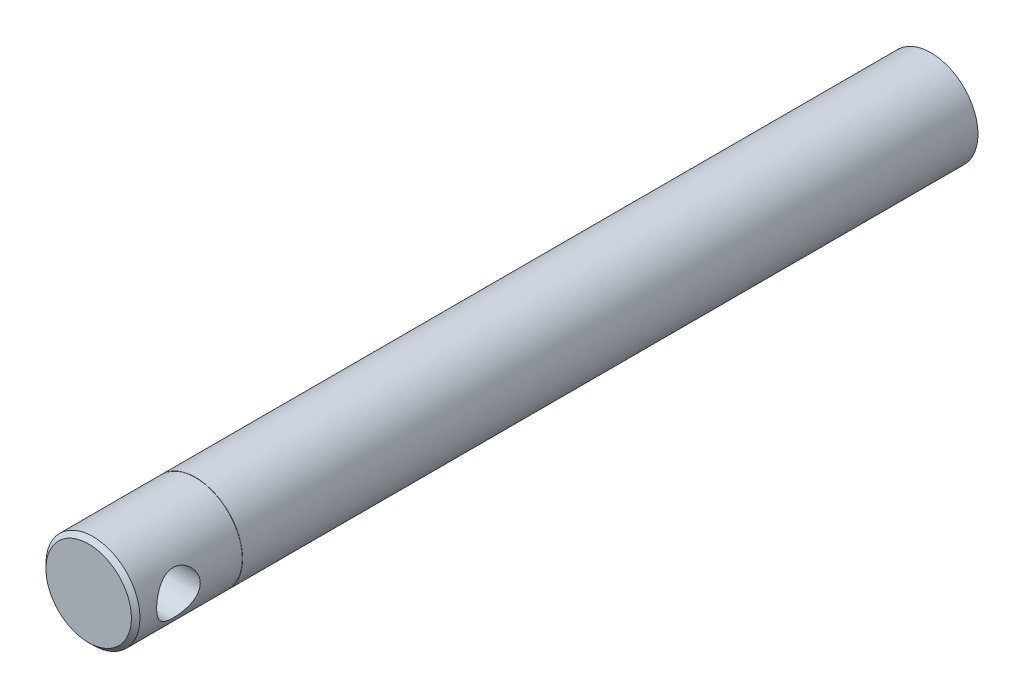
ISO-10303-21;
HEADER;
FILE_DESCRIPTION(('STEP AP214'),'2;1');
FILE_NAME('part.step','',(''),(''),'','','');
FILE_SCHEMA(('AUTOMOTIVE_DESIGN { 1 0 10303 214 1 1 1 1 }'));
ENDSEC;
DATA;
#1=APPLICATION_CONTEXT('core data for automotive mechanical design processes');
#2=APPLICATION_PROTOCOL_DEFINITION('international standard','automotive_design',2000,#1);
#3=PRODUCT_CONTEXT('',#1,'mechanical');
#4=PRODUCT('Part','Part','',(#3));
#5=PRODUCT_RELATED_PRODUCT_CATEGORY('part','',(#4));
#6=PRODUCT_DEFINITION_FORMATION('','',#4);
#7=PRODUCT_DEFINITION_CONTEXT('part definition',#1,'design');
#8=PRODUCT_DEFINITION('design','',#6,#7);
#9=PRODUCT_DEFINITION_SHAPE('','',#8);
#10=(LENGTH_UNIT() NAMED_UNIT(*) SI_UNIT(.MILLI.,.METRE.));
#11=(NAMED_UNIT(*) PLANE_ANGLE_UNIT() SI_UNIT($,.RADIAN.));
#12=(NAMED_UNIT(*) SI_UNIT($,.STERADIAN.) SOLID_ANGLE_UNIT());
#13=UNCERTAINTY_MEASURE_WITH_UNIT(LENGTH_MEASURE(1.E-05),#10,'distance_accuracy_value','');
#14=(GEOMETRIC_REPRESENTATION_CONTEXT(3) GLOBAL_UNCERTAINTY_ASSIGNED_CONTEXT((#13)) GLOBAL_UNIT_ASSIGNED_CONTEXT((#10,
#11,#12)) REPRESENTATION_CONTEXT('',''));
#15=CARTESIAN_POINT('',(0.,0.,0.));
#16=DIRECTION('',(0.,0.,1.));
#17=DIRECTION('',(1.,0.,0.));
#18=AXIS2_PLACEMENT_3D('',#15,#16,#17);
#19=CARTESIAN_POINT('',(0.,0.,172.));
#20=DIRECTION('',(0.,0.,1.));
#21=DIRECTION('',(1.,0.,0.));
#22=AXIS2_PLACEMENT_3D('',#19,#20,#21);
#23=PLANE('',#22);
#24=CARTESIAN_POINT('',(0.,0.,172.));
#25=DIRECTION('',(0.,0.,1.));
#26=DIRECTION('',(1.,0.,0.));
#27=AXIS2_PLACEMENT_3D('',#24,#25,#26);
#28=CIRCLE('',#27,11.);
#29=CARTESIAN_POINT('',(11.,0.,172.));
#30=VERTEX_POINT('',#29);
#31=EDGE_CURVE('E112',#30,#30,#28,.T.);
#32=ORIENTED_EDGE('',*,*,#31,.T.);
#33=EDGE_LOOP('',(#32));
#34=FACE_BOUND('',#33,.T.);
#35=CARTESIAN_POINT('',(0.,0.,172.));
#36=DIRECTION('',(0.,0.,1.));
#37=DIRECTION('',(1.,0.,0.));
#38=AXIS2_PLACEMENT_3D('',#35,#36,#37);
#39=CIRCLE('',#38,10.95);
#40=CARTESIAN_POINT('',(10.95,0.,172.));
#41=VERTEX_POINT('',#40);
#42=EDGE_CURVE('E107',#41,#41,#39,.T.);
#43=ORIENTED_EDGE('',*,*,#42,.F.);
#44=EDGE_LOOP('',(#43));
#45=FACE_BOUND('',#44,.T.);
#46=ADVANCED_FACE('F29',(#34,#45),#23,.T.);
#47=CARTESIAN_POINT('',(0.,0.,0.));
#48=DIRECTION('',(0.,0.,1.));
#49=DIRECTION('',(1.,0.,0.));
#50=AXIS2_PLACEMENT_3D('',#47,#48,#49);
#51=PLANE('',#50);
#52=CARTESIAN_POINT('',(0.,0.,0.));
#53=DIRECTION('',(0.,0.,1.));
#54=DIRECTION('',(1.,0.,0.));
#55=AXIS2_PLACEMENT_3D('',#52,#53,#54);
#56=CIRCLE('',#55,11.);
#57=CARTESIAN_POINT('',(11.,0.,0.));
#58=VERTEX_POINT('',#57);
#59=EDGE_CURVE('E104',#58,#58,#56,.T.);
#60=ORIENTED_EDGE('',*,*,#59,.F.);
#61=EDGE_LOOP('',(#60));
#62=FACE_BOUND('',#61,.T.);
#63=CARTESIAN_POINT('',(0.,0.,0.));
#64=DIRECTION('',(0.,0.,1.));
#65=DIRECTION('',(1.,0.,0.));
#66=AXIS2_PLACEMENT_3D('',#63,#64,#65);
#67=CIRCLE('',#66,10.);
#68=CARTESIAN_POINT('',(10.,0.,0.));
#69=VERTEX_POINT('',#68);
#70=EDGE_CURVE('E100',#69,#69,#67,.T.);
#71=ORIENTED_EDGE('',*,*,#70,.T.);
#72=EDGE_LOOP('',(#71));
#73=FACE_BOUND('',#72,.T.);
#74=ADVANCED_FACE('F76',(#62,#73),#51,.F.);
#75=CARTESIAN_POINT('',(0.,0.,172.));
#76=DIRECTION('',(0.,0.,-1.));
#77=DIRECTION('',(-1.,0.,0.));
#78=AXIS2_PLACEMENT_3D('',#75,#76,#77);
#79=CYLINDRICAL_SURFACE('',#78,11.);
#80=ORIENTED_EDGE('',*,*,#31,.F.);
#81=EDGE_LOOP('',(#80));
#82=FACE_BOUND('',#81,.T.);
#83=ORIENTED_EDGE('',*,*,#59,.T.);
#84=EDGE_LOOP('',(#83));
#85=FACE_BOUND('',#84,.T.);
#86=ADVANCED_FACE('F31',(#82,#85),#79,.T.);
#87=CARTESIAN_POINT('',(0.,0.,172.));
#88=DIRECTION('',(0.,0.,-1.));
#89=DIRECTION('',(-1.,0.,0.));
#90=AXIS2_PLACEMENT_3D('',#87,#88,#89);
#91=CYLINDRICAL_SURFACE('',#90,10.);
#92=CARTESIAN_POINT('',(0.,0.,172.));
#93=DIRECTION('',(0.,0.,1.));
#94=DIRECTION('',(1.,0.,0.));
#95=AXIS2_PLACEMENT_3D('',#92,#93,#94);
#96=CIRCLE('',#95,10.);
#97=CARTESIAN_POINT('',(10.,0.,172.));
#98=VERTEX_POINT('',#97);
#99=EDGE_CURVE('E99',#98,#98,#96,.T.);
#100=ORIENTED_EDGE('',*,*,#99,.T.);
#101=EDGE_LOOP('',(#100));
#102=FACE_BOUND('',#101,.T.);
#103=ORIENTED_EDGE('',*,*,#70,.F.);
#104=EDGE_LOOP('',(#103));
#105=FACE_BOUND('',#104,.T.);
#106=ADVANCED_FACE('F86',(#102,#105),#91,.F.);
#107=CARTESIAN_POINT('',(0.,0.,172.));
#108=DIRECTION('',(0.,0.,1.));
#109=DIRECTION('',(1.,0.,0.));
#110=AXIS2_PLACEMENT_3D('',#107,#108,#109);
#111=PLANE('',#110);
#112=ORIENTED_EDGE('',*,*,#99,.F.);
#113=EDGE_LOOP('',(#112));
#114=FACE_BOUND('',#113,.T.);
#115=ADVANCED_FACE('F89',(#114),#111,.F.);
#116=CARTESIAN_POINT('',(0.,0.,172.1));
#117=DIRECTION('',(0.,0.,-1.));
#118=DIRECTION('',(-1.,0.,0.));
#119=AXIS2_PLACEMENT_3D('',#116,#117,#118);
#120=CYLINDRICAL_SURFACE('',#119,10.95);
#121=CARTESIAN_POINT('',(0.,0.,172.1));
#122=DIRECTION('',(0.,0.,1.));
#123=DIRECTION('',(1.,0.,0.));
#124=AXIS2_PLACEMENT_3D('',#121,#122,#123);
#125=CIRCLE('',#124,10.95);
#126=CARTESIAN_POINT('',(10.95,0.,172.1));
#127=VERTEX_POINT('',#126);
#128=EDGE_CURVE('E101',#127,#127,#125,.T.);
#129=ORIENTED_EDGE('',*,*,#128,.F.);
#130=EDGE_LOOP('',(#129));
#131=FACE_BOUND('',#130,.T.);
#132=ORIENTED_EDGE('',*,*,#42,.T.);
#133=EDGE_LOOP('',(#132));
#134=FACE_BOUND('',#133,.T.);
#135=ADVANCED_FACE('F69',(#131,#134),#120,.T.);
#136=CARTESIAN_POINT('',(0.,0.,172.1));
#137=DIRECTION('',(0.,0.,1.));
#138=DIRECTION('',(1.,0.,0.));
#139=AXIS2_PLACEMENT_3D('',#136,#137,#138);
#140=PLANE('',#139);
#141=CARTESIAN_POINT('',(0.,0.,172.1));
#142=DIRECTION('',(0.,0.,1.));
#143=DIRECTION('',(1.,0.,0.));
#144=AXIS2_PLACEMENT_3D('',#141,#142,#143);
#145=CIRCLE('',#144,11.);
#146=CARTESIAN_POINT('',(11.,0.,172.1));
#147=VERTEX_POINT('',#146);
#148=EDGE_CURVE('E123',#147,#147,#145,.T.);
#149=ORIENTED_EDGE('',*,*,#148,.F.);
#150=EDGE_LOOP('',(#149));
#151=FACE_BOUND('',#150,.T.);
#152=ORIENTED_EDGE('',*,*,#128,.T.);
#153=EDGE_LOOP('',(#152));
#154=FACE_BOUND('',#153,.T.);
#155=ADVANCED_FACE('F66',(#151,#154),#140,.F.);
#156=CARTESIAN_POINT('',(0.,0.,197.));
#157=DIRECTION('',(0.,0.,-1.));
#158=DIRECTION('',(-1.,0.,0.));
#159=AXIS2_PLACEMENT_3D('',#156,#157,#158);
#160=CYLINDRICAL_SURFACE('',#159,11.);
#161=CARTESIAN_POINT('',(0.,0.,196.));
#162=DIRECTION('',(0.,0.,1.));
#163=DIRECTION('',(1.,0.,0.));
#164=AXIS2_PLACEMENT_3D('',#161,#162,#163);
#165=CIRCLE('',#164,11.);
#166=CARTESIAN_POINT('',(11.,0.,196.));
#167=VERTEX_POINT('',#166);
#168=EDGE_CURVE('E10',#167,#167,#165,.F.);
#169=ORIENTED_EDGE('',*,*,#168,.T.);
#170=EDGE_LOOP('',(#169));
#171=FACE_BOUND('',#170,.T.);
#172=CARTESIAN_POINT('',(-11.,0.,181.9));
#173=CARTESIAN_POINT('',(-10.9999991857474,0.135263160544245,181.900000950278));
#174=CARTESIAN_POINT('',(-10.9974987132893,0.270552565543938,181.905388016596));
#175=CARTESIAN_POINT('',(-10.9875589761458,0.54014985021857,181.926880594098));
#176=CARTESIAN_POINT('',(-10.9801171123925,0.674457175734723,181.942991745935));
#177=CARTESIAN_POINT('',(-10.9604719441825,0.941263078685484,181.98578945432));
#178=CARTESIAN_POINT('',(-10.9482604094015,1.07375811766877,182.012494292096));
#179=CARTESIAN_POINT('',(-10.9193872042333,1.33580363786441,182.076198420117));
#180=CARTESIAN_POINT('',(-10.9027237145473,1.46535289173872,182.113201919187));
#181=CARTESIAN_POINT('',(-10.865442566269,1.72007284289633,182.196954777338));
#182=CARTESIAN_POINT('',(-10.844841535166,1.84525942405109,182.243663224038));
#183=CARTESIAN_POINT('',(-10.8001405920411,2.09107754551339,182.346488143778));
#184=CARTESIAN_POINT('',(-10.7760393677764,2.21170735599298,182.402608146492));
#185=CARTESIAN_POINT('',(-10.6993393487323,2.56557893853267,182.584347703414));
#186=CARTESIAN_POINT('',(-10.6422972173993,2.7911098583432,182.723448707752));
#187=CARTESIAN_POINT('',(-10.5182187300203,3.22825263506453,183.042020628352));
#188=CARTESIAN_POINT('',(-10.4508083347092,3.43844833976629,183.223270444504));
#189=CARTESIAN_POINT('',(-10.3149249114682,3.82683367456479,183.617422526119));
#190=CARTESIAN_POINT('',(-10.2464512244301,4.00500251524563,183.830345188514));
#191=CARTESIAN_POINT('',(-10.1461469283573,4.25020195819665,184.177301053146));
#192=CARTESIAN_POINT('',(-10.112145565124,4.33026084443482,184.301703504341));
#193=CARTESIAN_POINT('',(-10.0469110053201,4.47953133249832,184.557522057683));
#194=CARTESIAN_POINT('',(-10.0156766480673,4.54874749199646,184.68893518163));
#195=CARTESIAN_POINT('',(-9.95703372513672,4.67572215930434,184.958001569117));
#196=CARTESIAN_POINT('',(-9.92962507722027,4.7334809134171,185.095654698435));
#197=CARTESIAN_POINT('',(-9.87965848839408,4.8369049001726,185.37621330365));
#198=CARTESIAN_POINT('',(-9.85709785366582,4.88257685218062,185.519115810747));
#199=CARTESIAN_POINT('',(-9.81879669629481,4.95912926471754,185.801166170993));
#200=CARTESIAN_POINT('',(-9.80274965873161,4.99068432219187,185.940089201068));
#201=CARTESIAN_POINT('',(-9.77640295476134,5.04210108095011,186.220558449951));
#202=CARTESIAN_POINT('',(-9.7661004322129,5.06196859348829,186.362103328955));
#203=CARTESIAN_POINT('',(-9.75165143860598,5.08974859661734,186.64661563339));
#204=CARTESIAN_POINT('',(-9.74750235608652,5.09766615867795,186.789582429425));
#205=CARTESIAN_POINT('',(-9.74552575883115,5.10144433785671,187.075713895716));
#206=CARTESIAN_POINT('',(-9.74769777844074,5.09730584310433,187.21887855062));
#207=CARTESIAN_POINT('',(-9.75774197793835,5.07804785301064,187.489908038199));
#208=CARTESIAN_POINT('',(-9.76502524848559,5.06406240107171,187.617877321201));
#209=CARTESIAN_POINT('',(-9.78439832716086,5.02652915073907,187.872076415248));
#210=CARTESIAN_POINT('',(-9.79648967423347,5.00297829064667,187.998305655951));
#211=CARTESIAN_POINT('',(-9.8250923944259,4.94657029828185,188.248132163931));
#212=CARTESIAN_POINT('',(-9.84160297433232,4.91371483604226,188.371729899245));
#213=CARTESIAN_POINT('',(-9.87854214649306,4.83902203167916,188.615597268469));
#214=CARTESIAN_POINT('',(-9.89897226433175,4.79718119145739,188.735865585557));
#215=CARTESIAN_POINT('',(-9.96628983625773,4.65661515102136,189.096003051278));
#216=CARTESIAN_POINT('',(-10.0185321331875,4.54410481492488,189.32965804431));
#217=CARTESIAN_POINT('',(-10.1315188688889,4.286265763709,189.775687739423));
#218=CARTESIAN_POINT('',(-10.1922670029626,4.14092276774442,189.988053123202));
#219=CARTESIAN_POINT('',(-10.3233083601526,3.80335210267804,190.409543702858));
#220=CARTESIAN_POINT('',(-10.3939273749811,3.60777168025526,190.615890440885));
#221=CARTESIAN_POINT('',(-10.5314179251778,3.18412967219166,190.993976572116));
#222=CARTESIAN_POINT('',(-10.5982881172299,2.95605654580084,191.165703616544));
#223=CARTESIAN_POINT('',(-10.6916930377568,2.58929933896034,191.396297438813));
#224=CARTESIAN_POINT('',(-10.7221337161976,2.460517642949,191.469666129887));
#225=CARTESIAN_POINT('',(-10.7793300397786,2.19641873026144,191.605186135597));
#226=CARTESIAN_POINT('',(-10.8060872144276,2.06110425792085,191.667342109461));
#227=CARTESIAN_POINT('',(-10.855127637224,1.7849029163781,191.779785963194));
#228=CARTESIAN_POINT('',(-10.8774123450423,1.64401788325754,191.830077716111));
#229=CARTESIAN_POINT('',(-10.9168441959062,1.35771192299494,191.918235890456));
#230=CARTESIAN_POINT('',(-10.9339918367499,1.21229143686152,191.956103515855));
#231=CARTESIAN_POINT('',(-10.9615450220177,0.929106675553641,192.016586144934));
#232=CARTESIAN_POINT('',(-10.972357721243,0.791579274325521,192.04012739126));
#233=CARTESIAN_POINT('',(-10.9888236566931,0.514756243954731,192.075874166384));
#234=CARTESIAN_POINT('',(-10.9944772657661,0.375460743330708,192.088080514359));
#235=CARTESIAN_POINT('',(-11.0004647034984,0.0962677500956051,192.101005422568));
#236=CARTESIAN_POINT('',(-11.0008001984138,-0.0436295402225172,192.101727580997));
#237=CARTESIAN_POINT('',(-10.9961459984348,-0.322919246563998,192.091684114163));
#238=CARTESIAN_POINT('',(-10.9911564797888,-0.462311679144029,192.080918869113));
#239=CARTESIAN_POINT('',(-10.9764860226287,-0.73048450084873,192.049101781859));
#240=CARTESIAN_POINT('',(-10.9671296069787,-0.859367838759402,192.028760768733));
#241=CARTESIAN_POINT('',(-10.944109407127,-1.11486742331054,191.978356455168));
#242=CARTESIAN_POINT('',(-10.9304442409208,-1.24148292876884,191.948290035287));
#243=CARTESIAN_POINT('',(-10.8991341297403,-1.49155716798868,191.878738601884));
#244=CARTESIAN_POINT('',(-10.881490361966,-1.61501682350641,191.839256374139));
#245=CARTESIAN_POINT('',(-10.8426311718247,-1.85810045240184,191.751231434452));
#246=CARTESIAN_POINT('',(-10.8214143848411,-1.97772293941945,191.702685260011));
#247=CARTESIAN_POINT('',(-10.7517072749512,-2.33693589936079,191.540811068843));
#248=CARTESIAN_POINT('',(-10.6981367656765,-2.56935571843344,191.413340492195));
#249=CARTESIAN_POINT('',(-10.5825684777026,-3.01021277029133,191.125302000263));
#250=CARTESIAN_POINT('',(-10.5205669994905,-3.21863940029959,190.964719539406));
#251=CARTESIAN_POINT('',(-10.3879679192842,-3.62485946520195,190.598814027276));
#252=CARTESIAN_POINT('',(-10.3170913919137,-3.82015778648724,190.390816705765));
#253=CARTESIAN_POINT('',(-10.1790610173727,-4.1740736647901,189.944186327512));
#254=CARTESIAN_POINT('',(-10.1119088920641,-4.3326743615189,189.705539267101));
#255=CARTESIAN_POINT('',(-10.0189090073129,-4.5417548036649,189.324732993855));
#256=CARTESIAN_POINT('',(-9.9887958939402,-4.60742117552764,189.191750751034));
#257=CARTESIAN_POINT('',(-9.93268297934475,-4.72717466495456,188.919857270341));
#258=CARTESIAN_POINT('',(-9.90668133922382,-4.78126696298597,188.780948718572));
#259=CARTESIAN_POINT('',(-9.85978303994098,-4.87724668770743,188.498245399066));
#260=CARTESIAN_POINT('',(-9.83888297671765,-4.91914225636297,188.354453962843));
#261=CARTESIAN_POINT('',(-9.80301811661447,-4.99023317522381,188.063040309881));
#262=CARTESIAN_POINT('',(-9.78805256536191,-5.0194301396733,187.915418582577));
#263=CARTESIAN_POINT('',(-9.76575065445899,-5.0626720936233,187.630995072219));
#264=CARTESIAN_POINT('',(-9.75785144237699,-5.07783914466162,187.494407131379));
#265=CARTESIAN_POINT('',(-9.747807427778,-5.09709437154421,187.220245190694));
#266=CARTESIAN_POINT('',(-9.74566218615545,-5.10118339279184,187.082671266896));
#267=CARTESIAN_POINT('',(-9.74720872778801,-5.09822754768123,186.807709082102));
#268=CARTESIAN_POINT('',(-9.75089918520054,-5.09118521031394,186.670320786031));
#269=CARTESIAN_POINT('',(-9.76397198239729,-5.06606851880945,186.396835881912));
#270=CARTESIAN_POINT('',(-9.77335419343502,-5.04799441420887,186.260739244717));
#271=CARTESIAN_POINT('',(-9.79659834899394,-5.00272503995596,186.000544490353));
#272=CARTESIAN_POINT('',(-9.81009266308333,-4.97627305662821,185.876283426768));
#273=CARTESIAN_POINT('',(-9.84126467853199,-4.91433635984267,185.630556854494));
#274=CARTESIAN_POINT('',(-9.85894370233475,-4.8788487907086,185.509092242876));
#275=CARTESIAN_POINT('',(-9.91750437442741,-4.75931154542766,185.149999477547));
#276=CARTESIAN_POINT('',(-9.96392614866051,-4.66215686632,184.917499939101));
#277=CARTESIAN_POINT('',(-10.0700591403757,-4.42846950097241,184.456400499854));
#278=CARTESIAN_POINT('',(-10.1304452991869,-4.28976088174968,184.229070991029));
#279=CARTESIAN_POINT('',(-10.2562611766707,-3.97959212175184,183.799513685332));
#280=CARTESIAN_POINT('',(-10.3216932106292,-3.80811689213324,183.597297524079));
#281=CARTESIAN_POINT('',(-10.4579897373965,-3.41719403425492,183.203012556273));
#282=CARTESIAN_POINT('',(-10.5287542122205,-3.1946842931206,183.013907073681));
#283=CARTESIAN_POINT('',(-10.6282971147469,-2.83807287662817,182.760102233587));
#284=CARTESIAN_POINT('',(-10.6604011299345,-2.71528417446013,182.680422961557));
#285=CARTESIAN_POINT('',(-10.7215507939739,-2.46275908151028,182.531638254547));
#286=CARTESIAN_POINT('',(-10.7505978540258,-2.33302593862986,182.462527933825));
#287=CARTESIAN_POINT('',(-10.8046674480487,-2.06817142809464,182.335870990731));
#288=CARTESIAN_POINT('',(-10.8297119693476,-1.93308497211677,182.27826072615));
#289=CARTESIAN_POINT('',(-10.8752498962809,-1.65782444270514,182.174730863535));
#290=CARTESIAN_POINT('',(-10.8957455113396,-1.51765287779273,182.128805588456));
#291=CARTESIAN_POINT('',(-10.9315478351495,-1.23357689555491,182.04924272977));
#292=CARTESIAN_POINT('',(-10.9468666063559,-1.08968200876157,182.015576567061));
#293=CARTESIAN_POINT('',(-10.9719030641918,-0.799110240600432,181.960828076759));
#294=CARTESIAN_POINT('',(-10.9816244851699,-0.652435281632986,181.939737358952));
#295=CARTESIAN_POINT('',(-10.9922548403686,-0.421181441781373,181.916722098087));
#296=CARTESIAN_POINT('',(-10.9951561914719,-0.337099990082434,181.910454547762));
#297=CARTESIAN_POINT('',(-10.9990290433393,-0.168682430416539,181.902093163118));
#298=CARTESIAN_POINT('',(-11.0000005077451,-0.0843463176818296,181.899999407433));
#299=CARTESIAN_POINT('',(-11.,0.,181.9));
#300=B_SPLINE_CURVE_WITH_KNOTS('',3,(#172,#173,#174,#175,#176,#177,#178,#179,#180,#181,#182,
#183,#184,#185,#186,#187,#188,#189,#190,#191,#192,#193,#194,#195,#196,#197,#198,#199,#200,#201,
#202,#203,#204,#205,#206,#207,#208,#209,#210,#211,#212,#213,#214,#215,#216,#217,#218,#219,#220,
#221,#222,#223,#224,#225,#226,#227,#228,#229,#230,#231,#232,#233,#234,#235,#236,#237,#238,#239,
#240,#241,#242,#243,#244,#245,#246,#247,#248,#249,#250,#251,#252,#253,#254,#255,#256,#257,#258,
#259,#260,#261,#262,#263,#264,#265,#266,#267,#268,#269,#270,#271,#272,#273,#274,#275,#276,#277,
#278,#279,#280,#281,#282,#283,#284,#285,#286,#287,#288,#289,#290,#291,#292,#293,#294,#295,#296,
#297,#298,#299),.UNSPECIFIED.,.T.,.F.,(4,2,2,2,2,2,2,2,2,2,2,2,2,2,2,2,2,2,2,2,2,2,2,2,2,2,2,2,
2,2,2,2,2,2,2,2,2,2,2,2,2,2,2,2,2,2,2,2,2,2,2,2,2,2,2,2,2,2,2,2,2,2,2,4),(0.,0.405705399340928,
0.811624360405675,1.21824687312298,1.62503580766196,2.03014345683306,2.43540337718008,
3.24495395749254,4.09836551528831,4.95232905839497,5.40723525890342,5.86194972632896,
6.3166544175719,6.77110579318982,7.20059850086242,7.62987747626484,8.05897421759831,
8.48803934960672,8.87439571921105,9.26087585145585,9.64728666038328,10.0338481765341,
10.8239583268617,11.6144128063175,12.4894521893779,13.3648031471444,13.8182279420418,
14.2714638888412,14.7245516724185,15.1775955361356,15.5968830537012,16.0161402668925,
16.4352661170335,16.8543780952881,17.2463655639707,17.6384788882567,18.0304763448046,
18.4226238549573,19.230238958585,20.0382095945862,20.9163434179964,21.7948798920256,
22.2483838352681,22.7016843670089,23.154681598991,23.6076212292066,24.0200303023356,
24.4324079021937,24.8446918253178,25.2569664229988,25.6398083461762,26.022771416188,
26.7881758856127,27.6041025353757,28.4204058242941,29.3171453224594,29.7662545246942,
30.2151554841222,30.6614987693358,31.1076247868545,31.5527040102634,31.9974859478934,
32.2504677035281,32.5034542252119),.UNSPECIFIED.);
#301=CARTESIAN_POINT('',(-11.,0.,181.9));
#302=VERTEX_POINT('',#301);
#303=EDGE_CURVE('E40',#302,#302,#300,.T.);
#304=ORIENTED_EDGE('',*,*,#303,.T.);
#305=EDGE_LOOP('',(#304));
#306=FACE_BOUND('',#305,.T.);
#307=CARTESIAN_POINT('',(11.,0.,181.9));
#308=CARTESIAN_POINT('',(10.9999991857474,-0.135263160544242,181.900000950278));
#309=CARTESIAN_POINT('',(10.9974987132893,-0.270552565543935,181.905388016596));
#310=CARTESIAN_POINT('',(10.9875589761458,-0.540149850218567,181.926880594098));
#311=CARTESIAN_POINT('',(10.9801171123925,-0.67445717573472,181.942991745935));
#312=CARTESIAN_POINT('',(10.9604719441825,-0.941263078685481,181.98578945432));
#313=CARTESIAN_POINT('',(10.9482604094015,-1.07375811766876,182.012494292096));
#314=CARTESIAN_POINT('',(10.9193872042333,-1.33580363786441,182.076198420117));
#315=CARTESIAN_POINT('',(10.9027237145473,-1.46535289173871,182.113201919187));
#316=CARTESIAN_POINT('',(10.865442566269,-1.72007284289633,182.196954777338));
#317=CARTESIAN_POINT('',(10.844841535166,-1.84525942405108,182.243663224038));
#318=CARTESIAN_POINT('',(10.8001405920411,-2.09107754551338,182.346488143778));
#319=CARTESIAN_POINT('',(10.7760393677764,-2.21170735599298,182.402608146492));
#320=CARTESIAN_POINT('',(10.6993393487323,-2.56557893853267,182.584347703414));
#321=CARTESIAN_POINT('',(10.6422972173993,-2.79110985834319,182.723448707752));
#322=CARTESIAN_POINT('',(10.5182187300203,-3.22825263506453,183.042020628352));
#323=CARTESIAN_POINT('',(10.4508083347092,-3.43844833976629,183.223270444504));
#324=CARTESIAN_POINT('',(10.3149249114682,-3.82683367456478,183.617422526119));
#325=CARTESIAN_POINT('',(10.2464512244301,-4.00500251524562,183.830345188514));
#326=CARTESIAN_POINT('',(10.1461469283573,-4.25020195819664,184.177301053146));
#327=CARTESIAN_POINT('',(10.112145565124,-4.33026084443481,184.301703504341));
#328=CARTESIAN_POINT('',(10.0469110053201,-4.47953133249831,184.557522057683));
#329=CARTESIAN_POINT('',(10.0156766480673,-4.54874749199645,184.68893518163));
#330=CARTESIAN_POINT('',(9.95703372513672,-4.67572215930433,184.958001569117));
#331=CARTESIAN_POINT('',(9.92962507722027,-4.7334809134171,185.095654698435));
#332=CARTESIAN_POINT('',(9.87965848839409,-4.83690490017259,185.37621330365));
#333=CARTESIAN_POINT('',(9.85709785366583,-4.88257685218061,185.519115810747));
#334=CARTESIAN_POINT('',(9.81879669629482,-4.95912926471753,185.801166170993));
#335=CARTESIAN_POINT('',(9.80274965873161,-4.99068432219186,185.940089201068));
#336=CARTESIAN_POINT('',(9.77640295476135,-5.0421010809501,186.220558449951));
#337=CARTESIAN_POINT('',(9.7661004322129,-5.06196859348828,186.362103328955));
#338=CARTESIAN_POINT('',(9.75165143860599,-5.08974859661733,186.64661563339));
#339=CARTESIAN_POINT('',(9.74750235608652,-5.09766615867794,186.789582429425));
#340=CARTESIAN_POINT('',(9.74552575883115,-5.10144433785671,187.075713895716));
#341=CARTESIAN_POINT('',(9.74769777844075,-5.09730584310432,187.21887855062));
#342=CARTESIAN_POINT('',(9.75774197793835,-5.07804785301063,187.489908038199));
#343=CARTESIAN_POINT('',(9.76502524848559,-5.06406240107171,187.617877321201));
#344=CARTESIAN_POINT('',(9.78439832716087,-5.02652915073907,187.872076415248));
#345=CARTESIAN_POINT('',(9.79648967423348,-5.00297829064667,187.998305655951));
#346=CARTESIAN_POINT('',(9.8250923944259,-4.94657029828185,188.248132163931));
#347=CARTESIAN_POINT('',(9.84160297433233,-4.91371483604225,188.371729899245));
#348=CARTESIAN_POINT('',(9.87854214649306,-4.83902203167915,188.615597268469));
#349=CARTESIAN_POINT('',(9.89897226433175,-4.79718119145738,188.735865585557));
#350=CARTESIAN_POINT('',(9.96628983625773,-4.65661515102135,189.096003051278));
#351=CARTESIAN_POINT('',(10.0185321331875,-4.54410481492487,189.32965804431));
#352=CARTESIAN_POINT('',(10.1315188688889,-4.28626576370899,189.775687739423));
#353=CARTESIAN_POINT('',(10.1922670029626,-4.14092276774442,189.988053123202));
#354=CARTESIAN_POINT('',(10.3233083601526,-3.80335210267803,190.409543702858));
#355=CARTESIAN_POINT('',(10.3939273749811,-3.60777168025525,190.615890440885));
#356=CARTESIAN_POINT('',(10.5314179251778,-3.18412967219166,190.993976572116));
#357=CARTESIAN_POINT('',(10.5982881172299,-2.95605654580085,191.165703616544));
#358=CARTESIAN_POINT('',(10.6916930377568,-2.58929933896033,191.396297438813));
#359=CARTESIAN_POINT('',(10.7221337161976,-2.46051764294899,191.469666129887));
#360=CARTESIAN_POINT('',(10.7793300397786,-2.19641873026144,191.605186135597));
#361=CARTESIAN_POINT('',(10.8060872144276,-2.06110425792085,191.667342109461));
#362=CARTESIAN_POINT('',(10.855127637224,-1.7849029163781,191.779785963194));
#363=CARTESIAN_POINT('',(10.8774123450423,-1.64401788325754,191.830077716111));
#364=CARTESIAN_POINT('',(10.9168441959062,-1.35771192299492,191.918235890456));
#365=CARTESIAN_POINT('',(10.9339918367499,-1.21229143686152,191.956103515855));
#366=CARTESIAN_POINT('',(10.9615450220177,-0.929106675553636,192.016586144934));
#367=CARTESIAN_POINT('',(10.972357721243,-0.791579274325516,192.04012739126));
#368=CARTESIAN_POINT('',(10.9888236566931,-0.514756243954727,192.075874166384));
#369=CARTESIAN_POINT('',(10.9944772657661,-0.375460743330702,192.088080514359));
#370=CARTESIAN_POINT('',(11.0004647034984,-0.0962677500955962,192.101005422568));
#371=CARTESIAN_POINT('',(11.0008001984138,0.0436295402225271,192.101727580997));
#372=CARTESIAN_POINT('',(10.9961459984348,0.322919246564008,192.091684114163));
#373=CARTESIAN_POINT('',(10.9911564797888,0.462311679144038,192.080918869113));
#374=CARTESIAN_POINT('',(10.9764860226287,0.730484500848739,192.049101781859));
#375=CARTESIAN_POINT('',(10.9671296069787,0.859367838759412,192.028760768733));
#376=CARTESIAN_POINT('',(10.944109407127,1.11486742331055,191.978356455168));
#377=CARTESIAN_POINT('',(10.9304442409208,1.24148292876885,191.948290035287));
#378=CARTESIAN_POINT('',(10.8991341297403,1.49155716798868,191.878738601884));
#379=CARTESIAN_POINT('',(10.881490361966,1.61501682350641,191.839256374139));
#380=CARTESIAN_POINT('',(10.8426311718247,1.85810045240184,191.751231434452));
#381=CARTESIAN_POINT('',(10.8214143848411,1.97772293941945,191.702685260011));
#382=CARTESIAN_POINT('',(10.7517072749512,2.33693589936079,191.540811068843));
#383=CARTESIAN_POINT('',(10.6981367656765,2.56935571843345,191.413340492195));
#384=CARTESIAN_POINT('',(10.5825684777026,3.01021277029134,191.125302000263));
#385=CARTESIAN_POINT('',(10.5205669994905,3.21863940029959,190.964719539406));
#386=CARTESIAN_POINT('',(10.3879679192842,3.62485946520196,190.598814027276));
#387=CARTESIAN_POINT('',(10.3170913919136,3.82015778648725,190.390816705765));
#388=CARTESIAN_POINT('',(10.1790610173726,4.17407366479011,189.944186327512));
#389=CARTESIAN_POINT('',(10.1119088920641,4.3326743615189,189.705539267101));
#390=CARTESIAN_POINT('',(10.0189090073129,4.5417548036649,189.324732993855));
#391=CARTESIAN_POINT('',(9.9887958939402,4.60742117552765,189.191750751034));
#392=CARTESIAN_POINT('',(9.93268297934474,4.72717466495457,188.919857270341));
#393=CARTESIAN_POINT('',(9.90668133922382,4.78126696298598,188.780948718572));
#394=CARTESIAN_POINT('',(9.85978303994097,4.87724668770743,188.498245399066));
#395=CARTESIAN_POINT('',(9.83888297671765,4.91914225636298,188.354453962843));
#396=CARTESIAN_POINT('',(9.80301811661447,4.99023317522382,188.063040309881));
#397=CARTESIAN_POINT('',(9.7880525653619,5.01943013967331,187.915418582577));
#398=CARTESIAN_POINT('',(9.76575065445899,5.06267209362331,187.630995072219));
#399=CARTESIAN_POINT('',(9.75785144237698,5.07783914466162,187.494407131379));
#400=CARTESIAN_POINT('',(9.747807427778,5.09709437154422,187.220245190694));
#401=CARTESIAN_POINT('',(9.74566218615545,5.10118339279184,187.082671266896));
#402=CARTESIAN_POINT('',(9.747208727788,5.09822754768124,186.807709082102));
#403=CARTESIAN_POINT('',(9.75089918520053,5.09118521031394,186.670320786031));
#404=CARTESIAN_POINT('',(9.76397198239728,5.06606851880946,186.396835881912));
#405=CARTESIAN_POINT('',(9.77335419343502,5.04799441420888,186.260739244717));
#406=CARTESIAN_POINT('',(9.79659834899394,5.00272503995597,186.000544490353));
#407=CARTESIAN_POINT('',(9.81009266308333,4.97627305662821,185.876283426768));
#408=CARTESIAN_POINT('',(9.84126467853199,4.91433635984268,185.630556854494));
#409=CARTESIAN_POINT('',(9.85894370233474,4.8788487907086,185.509092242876));
#410=CARTESIAN_POINT('',(9.91750437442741,4.75931154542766,185.149999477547));
#411=CARTESIAN_POINT('',(9.96392614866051,4.66215686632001,184.917499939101));
#412=CARTESIAN_POINT('',(10.0700591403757,4.42846950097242,184.456400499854));
#413=CARTESIAN_POINT('',(10.1304452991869,4.28976088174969,184.229070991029));
#414=CARTESIAN_POINT('',(10.2562611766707,3.97959212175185,183.799513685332));
#415=CARTESIAN_POINT('',(10.3216932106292,3.80811689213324,183.597297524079));
#416=CARTESIAN_POINT('',(10.4579897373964,3.41719403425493,183.203012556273));
#417=CARTESIAN_POINT('',(10.5287542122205,3.19468429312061,183.013907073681));
#418=CARTESIAN_POINT('',(10.6282971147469,2.83807287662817,182.760102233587));
#419=CARTESIAN_POINT('',(10.6604011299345,2.71528417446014,182.680422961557));
#420=CARTESIAN_POINT('',(10.7215507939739,2.46275908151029,182.531638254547));
#421=CARTESIAN_POINT('',(10.7505978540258,2.33302593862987,182.462527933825));
#422=CARTESIAN_POINT('',(10.8046674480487,2.06817142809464,182.335870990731));
#423=CARTESIAN_POINT('',(10.8297119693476,1.93308497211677,182.27826072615));
#424=CARTESIAN_POINT('',(10.8752498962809,1.65782444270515,182.174730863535));
#425=CARTESIAN_POINT('',(10.8957455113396,1.51765287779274,182.128805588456));
#426=CARTESIAN_POINT('',(10.9315478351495,1.23357689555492,182.04924272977));
#427=CARTESIAN_POINT('',(10.9468666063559,1.08968200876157,182.015576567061));
#428=CARTESIAN_POINT('',(10.9719030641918,0.799110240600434,181.960828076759));
#429=CARTESIAN_POINT('',(10.9816244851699,0.652435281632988,181.939737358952));
#430=CARTESIAN_POINT('',(10.9922548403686,0.421181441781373,181.916722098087));
#431=CARTESIAN_POINT('',(10.9951561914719,0.337099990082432,181.910454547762));
#432=CARTESIAN_POINT('',(10.9990290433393,0.168682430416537,181.902093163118));
#433=CARTESIAN_POINT('',(11.0000005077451,0.0843463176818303,181.899999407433));
#434=CARTESIAN_POINT('',(11.,0.,181.9));
#435=B_SPLINE_CURVE_WITH_KNOTS('',3,(#307,#308,#309,#310,#311,#312,#313,#314,#315,#316,#317,
#318,#319,#320,#321,#322,#323,#324,#325,#326,#327,#328,#329,#330,#331,#332,#333,#334,#335,#336,
#337,#338,#339,#340,#341,#342,#343,#344,#345,#346,#347,#348,#349,#350,#351,#352,#353,#354,#355,
#356,#357,#358,#359,#360,#361,#362,#363,#364,#365,#366,#367,#368,#369,#370,#371,#372,#373,#374,
#375,#376,#377,#378,#379,#380,#381,#382,#383,#384,#385,#386,#387,#388,#389,#390,#391,#392,#393,
#394,#395,#396,#397,#398,#399,#400,#401,#402,#403,#404,#405,#406,#407,#408,#409,#410,#411,#412,
#413,#414,#415,#416,#417,#418,#419,#420,#421,#422,#423,#424,#425,#426,#427,#428,#429,#430,#431,
#432,#433,#434),.UNSPECIFIED.,.T.,.F.,(4,2,2,2,2,2,2,2,2,2,2,2,2,2,2,2,2,2,2,2,2,2,2,2,2,2,2,2,
2,2,2,2,2,2,2,2,2,2,2,2,2,2,2,2,2,2,2,2,2,2,2,2,2,2,2,2,2,2,2,2,2,2,2,4),(0.,0.405705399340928,
0.811624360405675,1.21824687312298,1.62503580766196,2.03014345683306,2.43540337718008,
3.24495395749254,4.09836551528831,4.95232905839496,5.40723525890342,5.86194972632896,
6.3166544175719,6.77110579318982,7.20059850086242,7.6298774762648,8.0589742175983,
8.48803934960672,8.87439571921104,9.26087585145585,9.64728666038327,10.0338481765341,
10.8239583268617,11.6144128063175,12.4894521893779,13.3648031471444,13.8182279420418,
14.2714638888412,14.7245516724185,15.1775955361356,15.5968830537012,16.0161402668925,
16.4352661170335,16.8543780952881,17.2463655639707,17.6384788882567,18.0304763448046,
18.4226238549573,19.230238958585,20.0382095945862,20.9163434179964,21.7948798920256,
22.2483838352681,22.7016843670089,23.154681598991,23.6076212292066,24.0200303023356,
24.4324079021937,24.8446918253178,25.2569664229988,25.6398083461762,26.022771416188,
26.7881758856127,27.6041025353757,28.4204058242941,29.3171453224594,29.7662545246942,
30.2151554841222,30.6614987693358,31.1076247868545,31.5527040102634,31.9974859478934,
32.2504677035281,32.5034542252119),.UNSPECIFIED.);
#436=CARTESIAN_POINT('',(11.,0.,181.9));
#437=VERTEX_POINT('',#436);
#438=EDGE_CURVE('E44',#437,#437,#435,.T.);
#439=ORIENTED_EDGE('',*,*,#438,.T.);
#440=EDGE_LOOP('',(#439));
#441=FACE_BOUND('',#440,.T.);
#442=ORIENTED_EDGE('',*,*,#148,.T.);
#443=EDGE_LOOP('',(#442));
#444=FACE_BOUND('',#443,.T.);
#445=ADVANCED_FACE('F54',(#171,#306,#441,#444),#160,.T.);
#446=CARTESIAN_POINT('',(0.,0.,197.));
#447=DIRECTION('',(0.,0.,1.));
#448=DIRECTION('',(1.,0.,0.));
#449=AXIS2_PLACEMENT_3D('',#446,#447,#448);
#450=PLANE('',#449);
#451=CARTESIAN_POINT('',(0.,0.,197.));
#452=DIRECTION('',(0.,0.,1.));
#453=DIRECTION('',(1.,0.,0.));
#454=AXIS2_PLACEMENT_3D('',#451,#452,#453);
#455=CIRCLE('',#454,9.99999999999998);
#456=CARTESIAN_POINT('',(9.99999999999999,0.,197.));
#457=VERTEX_POINT('',#456);
#458=EDGE_CURVE('E36',#457,#457,#455,.T.);
#459=ORIENTED_EDGE('',*,*,#458,.T.);
#460=EDGE_LOOP('',(#459));
#461=FACE_BOUND('',#460,.T.);
#462=ADVANCED_FACE('F64',(#461),#450,.T.);
#463=CARTESIAN_POINT('',(-11.,0.,187.));
#464=DIRECTION('',(1.,0.,0.));
#465=DIRECTION('',(0.,0.,-1.));
#466=AXIS2_PLACEMENT_3D('',#463,#464,#465);
#467=CYLINDRICAL_SURFACE('',#466,5.09999999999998);
#468=ORIENTED_EDGE('',*,*,#438,.F.);
#469=EDGE_LOOP('',(#468));
#470=FACE_BOUND('',#469,.T.);
#471=ORIENTED_EDGE('',*,*,#303,.F.);
#472=EDGE_LOOP('',(#471));
#473=FACE_BOUND('',#472,.T.);
#474=ADVANCED_FACE('F58',(#470,#473),#467,.F.);
#475=CARTESIAN_POINT('',(0.,0.,197.));
#476=DIRECTION('',(0.,0.,-1.));
#477=DIRECTION('',(-1.,0.,0.));
#478=AXIS2_PLACEMENT_3D('',#475,#476,#477);
#479=CONICAL_SURFACE('',#478,9.99999999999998,0.785398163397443);
#480=ORIENTED_EDGE('',*,*,#168,.F.);
#481=EDGE_LOOP('',(#480));
#482=FACE_BOUND('',#481,.T.);
#483=ORIENTED_EDGE('',*,*,#458,.F.);
#484=EDGE_LOOP('',(#483));
#485=FACE_BOUND('',#484,.T.);
#486=ADVANCED_FACE('F63',(#482,#485),#479,.T.);
#487=CLOSED_SHELL('',(#46,#74,#86,#106,#115,#135,#155,#445,#462,#474,#486));
#488=MANIFOLD_SOLID_BREP('B2',#487);
#489=ADVANCED_BREP_SHAPE_REPRESENTATION('',(#18,#488),#14);
#490=SHAPE_DEFINITION_REPRESENTATION(#9,#489);
ENDSEC;
END-ISO-10303-21;
